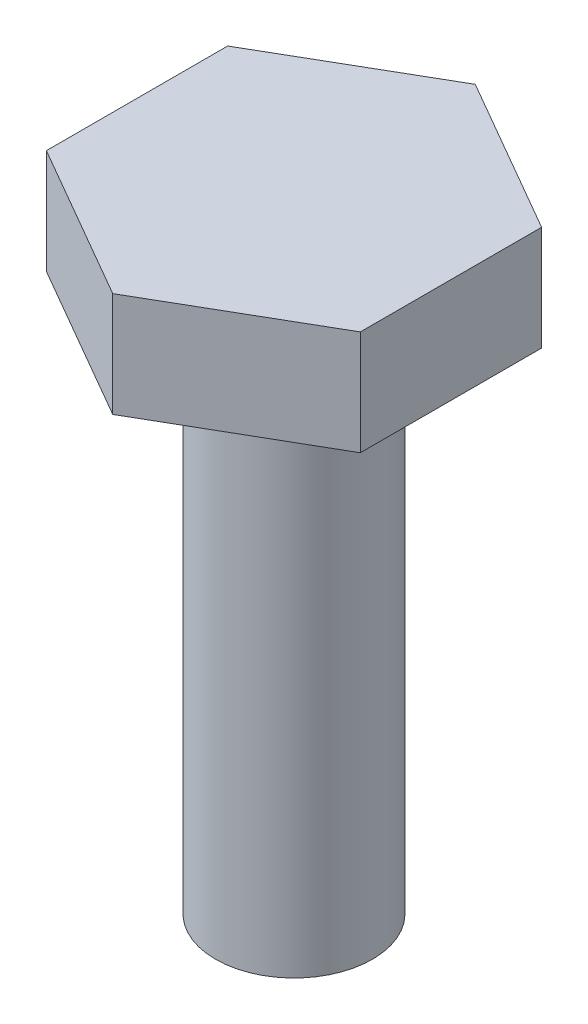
from build123d import *

# Parameters (mm, degrees)
EXTRUDE_1_DEPTH = 4
SKETCH_2_R      = 3
EXTRUDE_2_DEPTH = 20


with BuildPart() as part:
    # Sketch 1 → Extrude 1 (new body)
    with BuildSketch(Plane(origin=(0, 0, 0), x_dir=(1, 0, 0), z_dir=(0, 1, 0))):
        Polygon((0, 6.92820323), (-6, 3.464101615), (-6, -3.464101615), (0, -6.92820323), (6, -3.464101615), (6, 3.464101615), align=None)
    extrude(amount=EXTRUDE_1_DEPTH)

    # Sketch 2 → Extrude 2 (add)
    with BuildSketch(Plane(origin=(0, 0, 0), x_dir=(1, 0, 0), z_dir=(0, 1, 0))):
        with Locations(Location((0, 0, 0), (0, 0, 270))):
            Circle(SKETCH_2_R)
    extrude(amount=-EXTRUDE_2_DEPTH)


solid = part.part
